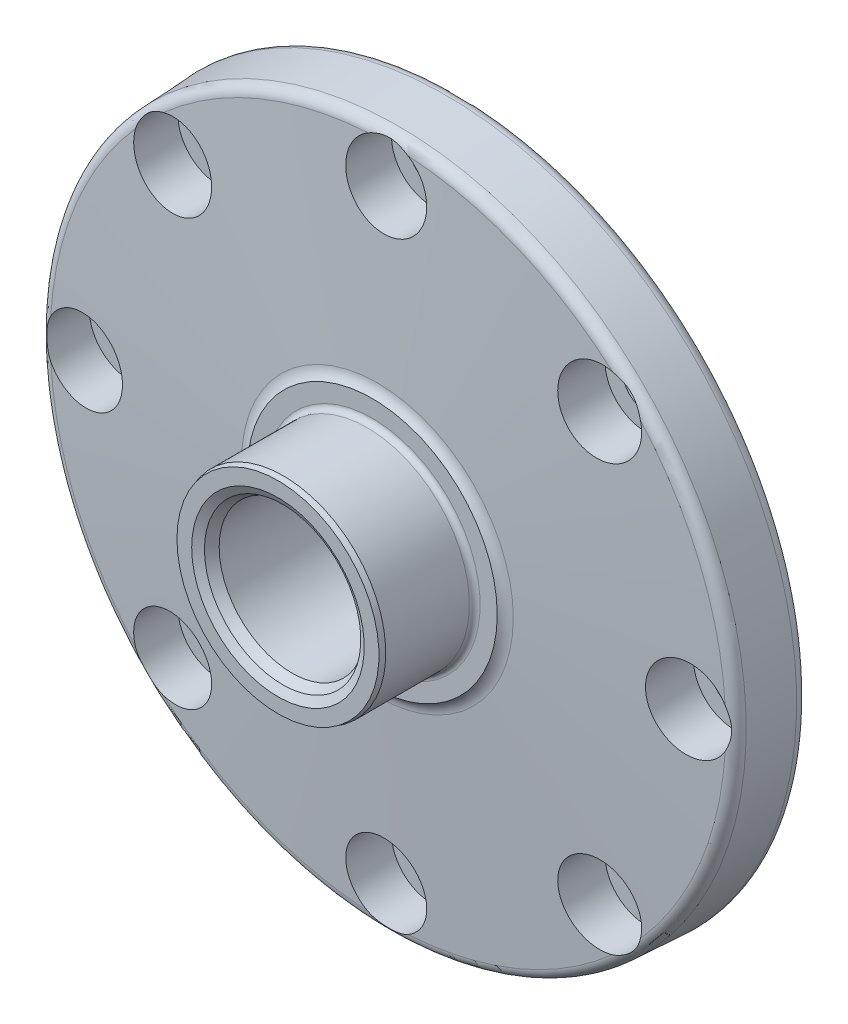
from build123d import *

# Parameters (mm, degrees)
CHANFREIN1_SIZE                                    = 1
CHANFREIN1_SIZE2                                   = 0.267949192
CHANFREIN2_SIZE                                    = 1
CHANFREIN2_SIZE2                                   = 0.267949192
ENL_V_MAT_EXTRU_1_DEPTH                            = 13.3
ENL_V_MAT_EXTRU_1_DEPTH_BACK                       = 100.587161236
CHAMBRAGE_POUR_VIS_T_TE_HEXAGONALE_M84_D           = 8.4
CHAMBRAGE_POUR_VIS_T_TE_HEXAGONALE_M84_CBORE_D     = 15
CHAMBRAGE_POUR_VIS_T_TE_HEXAGONALE_M84_CBORE_DEPTH = 11.05


with BuildPart() as part:
    # Esquisse1 → Brut-R_volution-1 (revolve)
    with BuildSketch(Plane(origin=(0, 0, 0), x_dir=(0, 0, -1), z_dir=(1, 0, 0)), mode=Mode.PRIVATE) as brut_r_volution_1_sk:
        with BuildLine():
            Line((-16.003710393, 64.533621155), (-7.104671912, 65))
            ThreePointArc((-7.104671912, 65), (-5.623290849, 64.453489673), (-5, 63.00274093))
            Line((-5, 63.00274093), (-5, 53.995888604))
            ThreePointArc((-5, 53.995888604), (-4.176123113, 51.930824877), (-2.157007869, 51))
            Line((-2.157007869, 51), (1.104671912, 50.829062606))
            ThreePointArc((1.104671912, 50.829062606), (2.450748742, 50.208512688), (3, 48.831803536))
            Line((3, 48.831803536), (3, 35))
            Line((3, 35), (-9.157007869, 34.362878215))
            ThreePointArc((-9.157007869, 34.362878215), (-11.176123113, 33.432053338), (-12, 31.366989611))
            Line((-12, 31.366989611), (-12, 14.365346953))
            ThreePointArc((-12, 14.365346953), (-12.549251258, 12.988637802), (-13.895328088, 12.368087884))
            Line((-13.895328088, 12.368087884), (-40, 11))
            Line((-40, 11), (-40, 19.553915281))
            ThreePointArc((-40, 19.553915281), (-39.450748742, 20.930624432), (-38.104671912, 21.55117435))
            Line((-38.104671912, 21.55117435), (-22.697510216, 22.35862948))
            ThreePointArc((-22.697510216, 22.35862948), (-20.733197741, 23.233197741), (-19.85862948, 25.197510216))
            Line((-19.85862948, 25.197510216), (-17.89629755, 62.641033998))
            ThreePointArc((-17.89629755, 62.641033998), (-17.313252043, 63.950575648), (-16.003710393, 64.533621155))
        make_face()
    revolve(brut_r_volution_1_sk.sketch.rotate(Axis((0, 0, 0), (0, 0, 1)), 90), axis=Axis((0, 0, 0), (0, 0, 1)))

    # Esquisse12 → Chariotage (revolve, cut)
    with BuildSketch(Plane(origin=(0, 0, 0), x_dir=(0, 0, -1), z_dir=(1, 0, 0)), mode=Mode.PRIVATE) as chariotage_sk:
        with BuildLine():
            Line((0, 42.5), (0, 49.465567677))
            Line((0, 49.465567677), (-1.5, 50.965567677))
            Line((-1.5, 50.965567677), (-1.5, 65.00274093))
            Line((-1.5, 65.00274093), (-20.8, 65.00274093))
            Line((-20.8, 65.00274093), (-20.8, 20))
            ThreePointArc((-20.8, 20), (-21.092893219, 19.292893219), (-21.8, 19))
            Line((-21.8, 19), (-38.3, 19))
            Line((-38.3, 19), (-38.3, 0))
            Line((-38.3, 0), (-52.337173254, 0))
            Line((-52.337173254, 0), (-52.337173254, 79.039914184))
            Line((-52.337173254, 79.039914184), (17.037173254, 79.039914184))
            Line((17.037173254, 79.039914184), (17.037173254, 0))
            Line((17.037173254, 0), (3, 0))
            Line((3, 0), (3, 42))
            Line((3, 42), (0.5, 42))
            ThreePointArc((0.5, 42), (0.146446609, 42.146446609), (0, 42.5))
        make_face()
    revolve(chariotage_sk.sketch.rotate(Axis((0, 0, 0), (0, 0, 1)), 90), axis=Axis((0, 0, 0), (0, 0, 1)), mode=Mode.SUBTRACT)

    # Chanfrein1
    chanfrein1_edges = [part.edges().sort_by_distance(p)[0] for p in [
        (19, 0, 38.3),
    ]]
    chanfrein1_side = [part.faces().sort_by_distance(p)[0] for p in [
        (19, 0, 30.05),
    ]]
    chamfer(chanfrein1_edges, length=CHANFREIN1_SIZE, length2=CHANFREIN1_SIZE2, reference=chanfrein1_side[0])

    # Chanfrein2
    chanfrein2_edges = [part.edges().sort_by_distance(p)[0] for p in [
        (42, 0, -3),
    ]]
    chanfrein2_side = [part.faces().sort_by_distance(p)[0] for p in [
        (42, 0, -1.75),
    ]]
    chamfer(chanfrein2_edges, length=CHANFREIN2_SIZE, length2=CHANFREIN2_SIZE2, reference=chanfrein2_side[0])

    # Esquisse13 → Al_sage (revolve, cut)
    with BuildSketch(Plane(origin=(0, 0, 0), x_dir=(0, 0, -1), z_dir=(1, 0, 0)), mode=Mode.PRIVATE) as al_sage_sk:
        Polygon((-38.3, 0), (3, 0), (3, 37.1), (-12.3, 37.1), (-12.3, 40.5), (-13.3, 40.5), (-13.3, 21), (-14.5, 21), (-14.5, 13.5), (-35.701923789, 13.5), (-37.433974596, 14.5), (-38.3, 16), align=None)
    revolve(al_sage_sk.sketch.rotate(Axis((0, 0, 0), (0, 0, 1)), 90), axis=Axis((0, 0, 0), (0, 0, 1)), mode=Mode.SUBTRACT)

    # Esquisse14 → Enl_v. mat.-Extru.1 (cut, two sides: drawn at the far end of the back side and taken through both)
    with BuildSketch(Plane.XY.offset(-ENL_V_MAT_EXTRU_1_DEPTH_BACK)):
        with BuildLine():
            ThreePointArc((-3.01091553, 37.479252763), (-14.388897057, 34.737870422), (-24.372794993, 28.630872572))
            ThreePointArc((-24.372794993, 28.630872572), (-24.50748836, 28.583228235), (-24.639604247, 28.637612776))
            ThreePointArc((-24.639604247, 28.637612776), (-26.380341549, 29.318080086), (-28.106461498, 28.601343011))
            ThreePointArc((-28.106461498, 28.601343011), (-28.354981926, 28.354981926), (-28.601343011, 28.106461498))
            ThreePointArc((-28.601343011, 28.106461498), (-29.318080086, 26.380341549), (-28.637612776, 24.639604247))
            ThreePointArc((-28.637612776, 24.639604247), (-28.583228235, 24.50748836), (-28.630872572, 24.372794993))
            ThreePointArc((-28.630872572, 24.372794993), (-29.065193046, 23.853187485), (-29.490084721, 23.32584196))
            ThreePointArc((-29.490084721, 23.32584196), (-29.612895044, 23.252835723), (-29.753082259, 23.28040075))
            ThreePointArc((-29.753082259, 23.28040075), (-31.593124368, 23.608192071), (-33.14624894, 22.568477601))
            ThreePointArc((-33.14624894, 22.568477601), (-33.341931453, 22.278366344), (-33.535074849, 21.986558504))
            ThreePointArc((-33.535074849, 21.986558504), (-33.901290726, 20.153776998), (-32.894297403, 18.579240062))
            ThreePointArc((-32.894297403, 18.579240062), (-32.815183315, 18.460272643), (-32.835634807, 18.318872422))
            ThreePointArc((-32.835634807, 18.318872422), (-33.160239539, 17.724517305), (-33.474087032, 17.124412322))
            ThreePointArc((-33.474087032, 17.124412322), (-33.580294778, 17.028849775), (-33.723166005, 17.028535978))
            ThreePointArc((-33.723166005, 17.028535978), (-35.591801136, 16.991054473), (-36.912244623, 15.668318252))
            ThreePointArc((-36.912244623, 15.668318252), (-37.047569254, 15.345605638), (-37.180072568, 15.021724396))
            ThreePointArc((-37.180072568, 15.021724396), (-37.181693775, 13.1527141), (-35.886872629, 11.804886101))
            ThreePointArc((-35.886872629, 11.804886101), (-35.786069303, 11.703639), (-35.778542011, 11.560965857))
            ThreePointArc((-35.778542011, 11.560965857), (-35.980956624, 10.914703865), (-36.17169895, 10.264901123))
            ThreePointArc((-36.17169895, 10.264901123), (-36.257222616, 10.15045468), (-36.397287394, 10.122274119))
            ThreePointArc((-36.397287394, 10.122274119), (-38.222704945, 9.720960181), (-39.259723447, 8.166034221))
            ThreePointArc((-39.259723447, 8.166034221), (-39.329489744, 7.823121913), (-39.396260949, 7.479613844))
            ThreePointArc((-39.396260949, 7.479613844), (-39.033225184, 5.646199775), (-37.500335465, 4.576876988))
            ThreePointArc((-37.500335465, 4.576876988), (-37.381716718, 4.497241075), (-37.346499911, 4.358777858))
            ThreePointArc((-37.346499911, 4.358777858), (-37.418945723, 3.685444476), (-37.479252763, 3.01091553))
            ThreePointArc((-37.479252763, 3.01091553), (-37.540805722, 2.881983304), (-37.67268144, 2.827018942))
            ThreePointArc((-37.67268144, 2.827018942), (-39.38473164, 2.077294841), (-40.098473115, 0.349934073))
            ThreePointArc((-40.098473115, 0.349934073), (-40.1, 0), (-40.098473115, -0.349934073))
            ThreePointArc((-40.098473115, -0.349934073), (-39.38473164, -2.077294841), (-37.67268144, -2.827018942))
            ThreePointArc((-37.67268144, -2.827018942), (-37.540805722, -2.881983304), (-37.479252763, -3.01091553))
            ThreePointArc((-37.479252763, -3.01091553), (-34.737870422, -14.388897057), (-28.630872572, -24.372794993))
            ThreePointArc((-28.630872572, -24.372794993), (-28.583228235, -24.50748836), (-28.637612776, -24.639604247))
            ThreePointArc((-28.637612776, -24.639604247), (-29.318080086, -26.380341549), (-28.601343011, -28.106461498))
            ThreePointArc((-28.601343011, -28.106461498), (-28.354981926, -28.354981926), (-28.106461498, -28.601343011))
            ThreePointArc((-28.106461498, -28.601343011), (-26.380341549, -29.318080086), (-24.639604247, -28.637612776))
            ThreePointArc((-24.639604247, -28.637612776), (-24.50748836, -28.583228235), (-24.372794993, -28.630872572))
            ThreePointArc((-24.372794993, -28.630872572), (-23.853187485, -29.065193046), (-23.32584196, -29.490084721))
            ThreePointArc((-23.32584196, -29.490084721), (-23.252835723, -29.612895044), (-23.28040075, -29.753082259))
            ThreePointArc((-23.28040075, -29.753082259), (-23.608192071, -31.593124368), (-22.568477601, -33.14624894))
            ThreePointArc((-22.568477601, -33.14624894), (-22.278366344, -33.341931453), (-21.986558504, -33.535074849))
            ThreePointArc((-21.986558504, -33.535074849), (-20.153776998, -33.901290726), (-18.579240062, -32.894297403))
            ThreePointArc((-18.579240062, -32.894297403), (-18.460272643, -32.815183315), (-18.318872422, -32.835634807))
            ThreePointArc((-18.318872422, -32.835634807), (-17.724517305, -33.160239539), (-17.124412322, -33.474087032))
            ThreePointArc((-17.124412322, -33.474087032), (-17.028849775, -33.580294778), (-17.028535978, -33.723166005))
            ThreePointArc((-17.028535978, -33.723166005), (-16.991054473, -35.591801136), (-15.668318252, -36.912244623))
            ThreePointArc((-15.668318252, -36.912244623), (-15.345605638, -37.047569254), (-15.021724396, -37.180072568))
            ThreePointArc((-15.021724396, -37.180072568), (-13.1527141, -37.181693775), (-11.804886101, -35.886872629))
            ThreePointArc((-11.804886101, -35.886872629), (-11.703639, -35.786069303), (-11.560965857, -35.778542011))
            ThreePointArc((-11.560965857, -35.778542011), (-10.914703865, -35.980956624), (-10.264901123, -36.17169895))
            ThreePointArc((-10.264901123, -36.17169895), (-10.15045468, -36.257222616), (-10.122274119, -36.397287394))
            ThreePointArc((-10.122274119, -36.397287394), (-9.720960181, -38.222704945), (-8.166034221, -39.259723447))
            ThreePointArc((-8.166034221, -39.259723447), (-7.823121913, -39.329489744), (-7.479613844, -39.396260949))
            ThreePointArc((-7.479613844, -39.396260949), (-5.646199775, -39.033225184), (-4.576876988, -37.500335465))
            ThreePointArc((-4.576876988, -37.500335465), (-4.497241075, -37.381716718), (-4.358777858, -37.346499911))
            ThreePointArc((-4.358777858, -37.346499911), (-3.685444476, -37.418945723), (-3.01091553, -37.479252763))
            ThreePointArc((-3.01091553, -37.479252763), (-2.881983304, -37.540805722), (-2.827018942, -37.67268144))
            ThreePointArc((-2.827018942, -37.67268144), (-2.077294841, -39.38473164), (-0.349934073, -40.098473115))
            ThreePointArc((-0.349934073, -40.098473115), (0, -40.1), (0.349934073, -40.098473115))
            ThreePointArc((0.349934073, -40.098473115), (2.077294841, -39.38473164), (2.827018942, -37.67268144))
            ThreePointArc((2.827018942, -37.67268144), (2.881983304, -37.540805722), (3.01091553, -37.479252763))
            ThreePointArc((3.01091553, -37.479252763), (14.388897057, -34.737870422), (24.372794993, -28.630872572))
            ThreePointArc((24.372794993, -28.630872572), (24.50748836, -28.583228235), (24.639604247, -28.637612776))
            ThreePointArc((24.639604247, -28.637612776), (26.380341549, -29.318080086), (28.106461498, -28.601343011))
            ThreePointArc((28.106461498, -28.601343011), (28.354981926, -28.354981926), (28.601343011, -28.106461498))
            ThreePointArc((28.601343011, -28.106461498), (29.318080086, -26.380341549), (28.637612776, -24.639604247))
            ThreePointArc((28.637612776, -24.639604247), (28.583228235, -24.50748836), (28.630872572, -24.372794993))
            ThreePointArc((28.630872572, -24.372794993), (29.065193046, -23.853187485), (29.490084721, -23.32584196))
            ThreePointArc((29.490084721, -23.32584196), (29.612895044, -23.252835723), (29.753082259, -23.28040075))
            ThreePointArc((29.753082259, -23.28040075), (31.593124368, -23.608192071), (33.14624894, -22.568477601))
            ThreePointArc((33.14624894, -22.568477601), (33.341931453, -22.278366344), (33.535074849, -21.986558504))
            ThreePointArc((33.535074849, -21.986558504), (33.901290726, -20.153776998), (32.894297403, -18.579240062))
            ThreePointArc((32.894297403, -18.579240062), (32.815183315, -18.460272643), (32.835634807, -18.318872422))
            ThreePointArc((32.835634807, -18.318872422), (33.160239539, -17.724517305), (33.474087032, -17.124412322))
            ThreePointArc((33.474087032, -17.124412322), (33.580294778, -17.028849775), (33.723166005, -17.028535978))
            ThreePointArc((33.723166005, -17.028535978), (35.591801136, -16.991054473), (36.912244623, -15.668318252))
            ThreePointArc((36.912244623, -15.668318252), (37.047569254, -15.345605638), (37.180072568, -15.021724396))
            ThreePointArc((37.180072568, -15.021724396), (37.181693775, -13.1527141), (35.886872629, -11.804886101))
            ThreePointArc((35.886872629, -11.804886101), (35.786069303, -11.703639), (35.778542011, -11.560965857))
            ThreePointArc((35.778542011, -11.560965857), (35.980956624, -10.914703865), (36.17169895, -10.264901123))
            ThreePointArc((36.17169895, -10.264901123), (36.257222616, -10.15045468), (36.397287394, -10.122274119))
            ThreePointArc((36.397287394, -10.122274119), (38.222704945, -9.720960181), (39.259723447, -8.166034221))
            ThreePointArc((39.259723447, -8.166034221), (39.329489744, -7.823121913), (39.396260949, -7.479613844))
            ThreePointArc((39.396260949, -7.479613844), (39.033225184, -5.646199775), (37.500335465, -4.576876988))
            ThreePointArc((37.500335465, -4.576876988), (37.381716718, -4.497241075), (37.346499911, -4.358777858))
            ThreePointArc((37.346499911, -4.358777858), (37.418945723, -3.685444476), (37.479252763, -3.01091553))
            ThreePointArc((37.479252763, -3.01091553), (37.540805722, -2.881983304), (37.67268144, -2.827018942))
            ThreePointArc((37.67268144, -2.827018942), (39.38473164, -2.077294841), (40.098473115, -0.349934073))
            ThreePointArc((40.098473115, -0.349934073), (40.1, 0), (40.098473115, 0.349934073))
            ThreePointArc((40.098473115, 0.349934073), (39.38473164, 2.077294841), (37.67268144, 2.827018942))
            ThreePointArc((37.67268144, 2.827018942), (37.540805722, 2.881983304), (37.479252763, 3.01091553))
            ThreePointArc((37.479252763, 3.01091553), (34.737870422, 14.388897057), (28.630872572, 24.372794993))
            ThreePointArc((28.630872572, 24.372794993), (28.583228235, 24.50748836), (28.637612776, 24.639604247))
            ThreePointArc((28.637612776, 24.639604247), (29.318080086, 26.380341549), (28.601343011, 28.106461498))
            ThreePointArc((28.601343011, 28.106461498), (28.354981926, 28.354981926), (28.106461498, 28.601343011))
            ThreePointArc((28.106461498, 28.601343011), (26.380341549, 29.318080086), (24.639604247, 28.637612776))
            ThreePointArc((24.639604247, 28.637612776), (24.50748836, 28.583228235), (24.372794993, 28.630872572))
            ThreePointArc((24.372794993, 28.630872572), (23.853187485, 29.065193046), (23.32584196, 29.490084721))
            ThreePointArc((23.32584196, 29.490084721), (23.252835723, 29.612895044), (23.28040075, 29.753082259))
            ThreePointArc((23.28040075, 29.753082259), (23.608192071, 31.593124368), (22.568477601, 33.14624894))
            ThreePointArc((22.568477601, 33.14624894), (22.278366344, 33.341931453), (21.986558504, 33.535074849))
            ThreePointArc((21.986558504, 33.535074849), (20.153776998, 33.901290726), (18.579240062, 32.894297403))
            ThreePointArc((18.579240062, 32.894297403), (18.460272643, 32.815183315), (18.318872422, 32.835634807))
            ThreePointArc((18.318872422, 32.835634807), (17.724517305, 33.160239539), (17.124412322, 33.474087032))
            ThreePointArc((17.124412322, 33.474087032), (17.028849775, 33.580294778), (17.028535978, 33.723166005))
            ThreePointArc((17.028535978, 33.723166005), (16.991054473, 35.591801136), (15.668318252, 36.912244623))
            ThreePointArc((15.668318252, 36.912244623), (15.345605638, 37.047569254), (15.021724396, 37.180072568))
            ThreePointArc((15.021724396, 37.180072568), (13.1527141, 37.181693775), (11.804886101, 35.886872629))
            ThreePointArc((11.804886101, 35.886872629), (11.703639, 35.786069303), (11.560965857, 35.778542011))
            ThreePointArc((11.560965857, 35.778542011), (10.914703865, 35.980956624), (10.264901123, 36.17169895))
            ThreePointArc((10.264901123, 36.17169895), (10.15045468, 36.257222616), (10.122274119, 36.397287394))
            ThreePointArc((10.122274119, 36.397287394), (9.720960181, 38.222704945), (8.166034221, 39.259723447))
            ThreePointArc((8.166034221, 39.259723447), (7.823121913, 39.329489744), (7.479613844, 39.396260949))
            ThreePointArc((7.479613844, 39.396260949), (5.646199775, 39.033225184), (4.576876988, 37.500335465))
            ThreePointArc((4.576876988, 37.500335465), (4.497241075, 37.381716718), (4.358777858, 37.346499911))
            ThreePointArc((4.358777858, 37.346499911), (3.685444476, 37.418945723), (3.01091553, 37.479252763))
            ThreePointArc((3.01091553, 37.479252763), (2.881983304, 37.540805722), (2.827018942, 37.67268144))
            ThreePointArc((2.827018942, 37.67268144), (2.077294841, 39.38473164), (0.349934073, 40.098473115))
            ThreePointArc((0.349934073, 40.098473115), (0, 40.1), (-0.349934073, 40.098473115))
            ThreePointArc((-0.349934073, 40.098473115), (-2.077294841, 39.38473164), (-2.827018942, 37.67268144))
            ThreePointArc((-2.827018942, 37.67268144), (-2.881983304, 37.540805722), (-3.01091553, 37.479252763))
        make_face()
    extrude(amount=ENL_V_MAT_EXTRU_1_DEPTH + ENL_V_MAT_EXTRU_1_DEPTH_BACK, mode=Mode.SUBTRACT)

    # Chambrage pour vis _ t_te hexagonale M84 (through all)
    with Locations(Plane(origin=(4.459360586, 43.120887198, 20.8), x_dir=(1, 0, 0), z_dir=(0, 0, 1))):
        with Locations((-4.459360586, -99.120887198), (-44.057340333, -82.718866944), (-60.459360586, -43.120887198), (-44.057340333, -3.522907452), (-4.459360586, 12.879112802), (35.13861916, -3.522907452), (51.540639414, -43.120887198), (35.13861916, -82.718866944)):
            CounterBoreHole(CHAMBRAGE_POUR_VIS_T_TE_HEXAGONALE_M84_D / 2, CHAMBRAGE_POUR_VIS_T_TE_HEXAGONALE_M84_CBORE_D / 2, CHAMBRAGE_POUR_VIS_T_TE_HEXAGONALE_M84_CBORE_DEPTH)


solid = part.part
